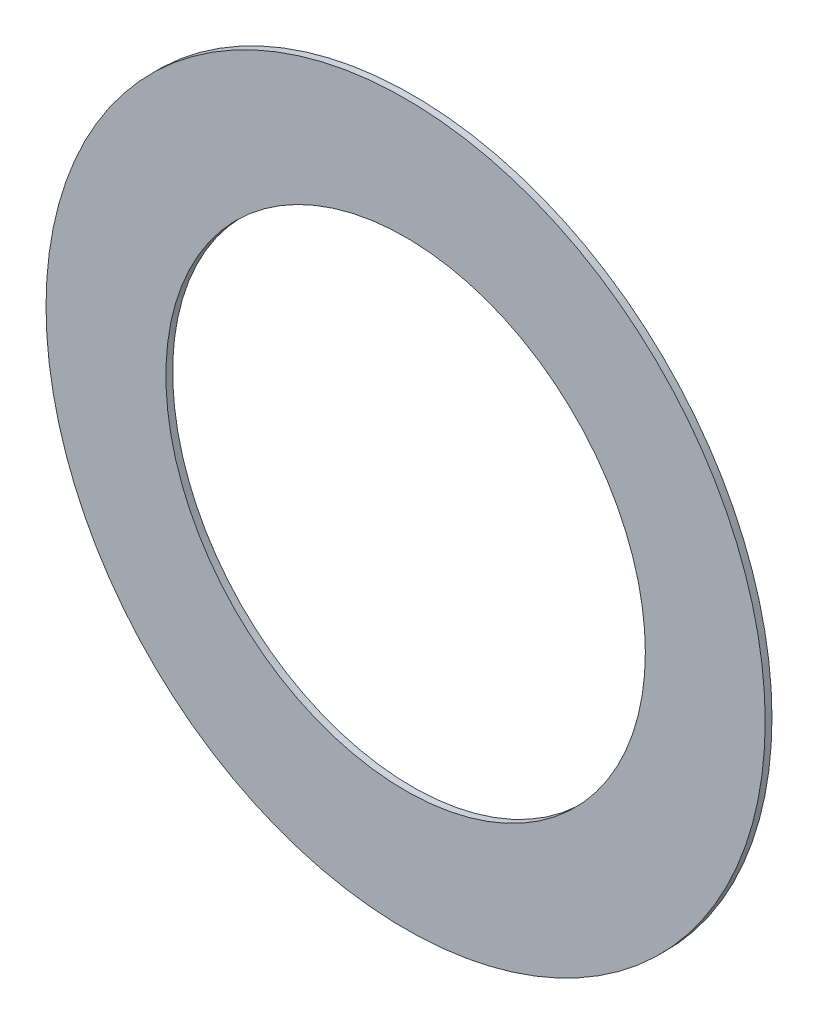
from build123d import *

# Parameters (mm, degrees)
SKETCH1_R           = 6.75
SKETCH1_R_2         = 4.5
BOSS_EXTRUDE1_DEPTH = 0.127


with BuildPart() as part:
    # Sketch1 → Boss-Extrude1 (new body)
    with BuildSketch(Plane.XY):
        Circle(SKETCH1_R)
        Circle(SKETCH1_R_2, mode=Mode.SUBTRACT)
    extrude(amount=BOSS_EXTRUDE1_DEPTH)


solid = part.part
